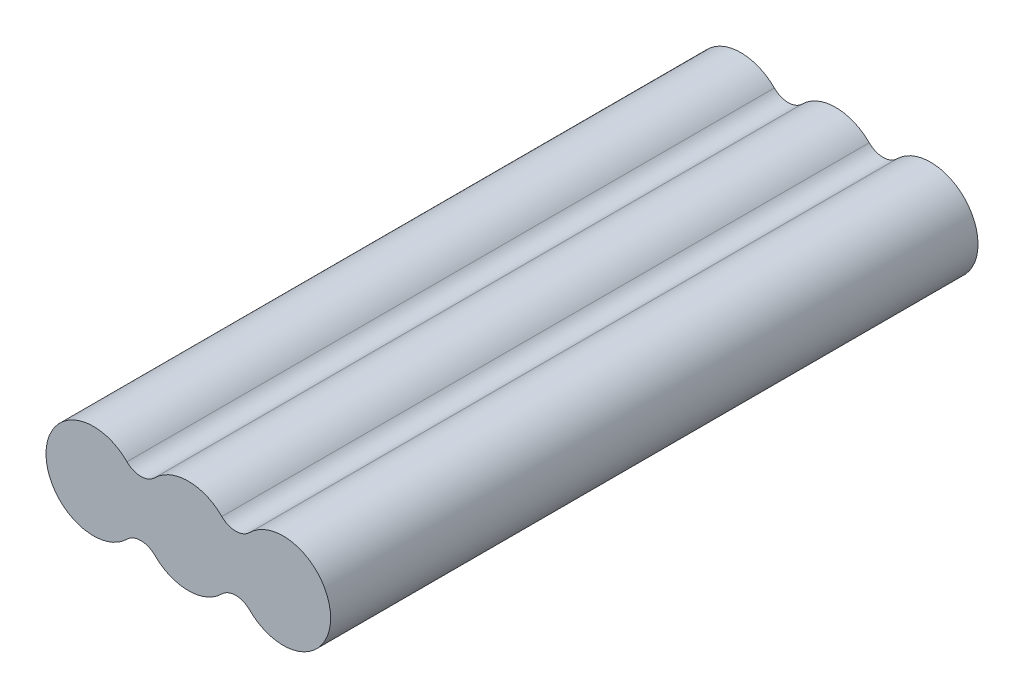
ISO-10303-21;
HEADER;
FILE_DESCRIPTION(('STEP AP214'),'2;1');
FILE_NAME('part.step','',(''),(''),'','','');
FILE_SCHEMA(('AUTOMOTIVE_DESIGN { 1 0 10303 214 1 1 1 1 }'));
ENDSEC;
DATA;
#1=APPLICATION_CONTEXT('core data for automotive mechanical design processes');
#2=APPLICATION_PROTOCOL_DEFINITION('international standard','automotive_design',2000,#1);
#3=PRODUCT_CONTEXT('',#1,'mechanical');
#4=PRODUCT('Part','Part','',(#3));
#5=PRODUCT_RELATED_PRODUCT_CATEGORY('part','',(#4));
#6=PRODUCT_DEFINITION_FORMATION('','',#4);
#7=PRODUCT_DEFINITION_CONTEXT('part definition',#1,'design');
#8=PRODUCT_DEFINITION('design','',#6,#7);
#9=PRODUCT_DEFINITION_SHAPE('','',#8);
#10=(LENGTH_UNIT() NAMED_UNIT(*) SI_UNIT(.MILLI.,.METRE.));
#11=(NAMED_UNIT(*) PLANE_ANGLE_UNIT() SI_UNIT($,.RADIAN.));
#12=(NAMED_UNIT(*) SI_UNIT($,.STERADIAN.) SOLID_ANGLE_UNIT());
#13=UNCERTAINTY_MEASURE_WITH_UNIT(LENGTH_MEASURE(1.E-05),#10,'distance_accuracy_value','');
#14=(GEOMETRIC_REPRESENTATION_CONTEXT(3) GLOBAL_UNCERTAINTY_ASSIGNED_CONTEXT((#13)) GLOBAL_UNIT_ASSIGNED_CONTEXT((#10,
#11,#12)) REPRESENTATION_CONTEXT('',''));
#15=CARTESIAN_POINT('',(0.,0.,0.));
#16=DIRECTION('',(0.,0.,1.));
#17=DIRECTION('',(1.,0.,0.));
#18=AXIS2_PLACEMENT_3D('',#15,#16,#17);
#19=CARTESIAN_POINT('',(-9.525,9.52500000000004,130.));
#20=DIRECTION('',(0.,0.,-1.));
#21=DIRECTION('',(-1.,0.,0.));
#22=AXIS2_PLACEMENT_3D('',#19,#20,#21);
#23=CYLINDRICAL_SURFACE('',#22,3.94538418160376);
#24=CARTESIAN_POINT('',(-9.525,9.52500000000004,0.));
#25=DIRECTION('',(0.,0.,-1.));
#26=DIRECTION('',(1.,0.,0.));
#27=AXIS2_PLACEMENT_3D('',#24,#25,#26);
#28=CIRCLE('',#27,3.94538418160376);
#29=CARTESIAN_POINT('',(-6.73519209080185,6.73519209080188,0.));
#30=VERTEX_POINT('',#29);
#31=CARTESIAN_POINT('',(-12.3148079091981,6.73519209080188,0.));
#32=VERTEX_POINT('',#31);
#33=EDGE_CURVE('E146',#30,#32,#28,.T.);
#34=ORIENTED_EDGE('',*,*,#33,.T.);
#35=DIRECTION('',(0.,0.,-1.));
#36=VECTOR('',#35,1.);
#37=CARTESIAN_POINT('',(-12.3148079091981,6.73519209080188,130.));
#38=LINE('',#37,#36);
#39=CARTESIAN_POINT('',(-12.3148079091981,6.73519209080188,130.));
#40=VERTEX_POINT('',#39);
#41=EDGE_CURVE('E11',#40,#32,#38,.T.);
#42=ORIENTED_EDGE('',*,*,#41,.F.);
#43=CARTESIAN_POINT('',(-9.525,9.52500000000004,130.));
#44=DIRECTION('',(0.,0.,-1.));
#45=DIRECTION('',(1.,0.,0.));
#46=AXIS2_PLACEMENT_3D('',#43,#44,#45);
#47=CIRCLE('',#46,3.94538418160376);
#48=CARTESIAN_POINT('',(-6.73519209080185,6.73519209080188,130.));
#49=VERTEX_POINT('',#48);
#50=EDGE_CURVE('E168',#49,#40,#47,.T.);
#51=ORIENTED_EDGE('',*,*,#50,.F.);
#52=DIRECTION('',(0.,0.,-1.));
#53=VECTOR('',#52,1.);
#54=CARTESIAN_POINT('',(-6.73519209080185,6.73519209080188,130.));
#55=LINE('',#54,#53);
#56=EDGE_CURVE('E142',#49,#30,#55,.T.);
#57=ORIENTED_EDGE('',*,*,#56,.T.);
#58=EDGE_LOOP('',(#34,#42,#51,#57));
#59=FACE_BOUND('',#58,.T.);
#60=ADVANCED_FACE('F45',(#59),#23,.F.);
#61=CARTESIAN_POINT('',(-19.05,0.,130.));
#62=DIRECTION('',(0.,0.,-1.));
#63=DIRECTION('',(-1.,0.,0.));
#64=AXIS2_PLACEMENT_3D('',#61,#62,#63);
#65=CYLINDRICAL_SURFACE('',#64,9.525);
#66=CARTESIAN_POINT('',(-19.05,0.,0.));
#67=DIRECTION('',(0.,0.,1.));
#68=DIRECTION('',(1.,0.,0.));
#69=AXIS2_PLACEMENT_3D('',#66,#67,#68);
#70=CIRCLE('',#69,9.525);
#71=CARTESIAN_POINT('',(-12.3148079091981,-6.73519209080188,0.));
#72=VERTEX_POINT('',#71);
#73=EDGE_CURVE('E150',#32,#72,#70,.T.);
#74=ORIENTED_EDGE('',*,*,#73,.T.);
#75=DIRECTION('',(0.,0.,-1.));
#76=VECTOR('',#75,1.);
#77=CARTESIAN_POINT('',(-12.3148079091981,-6.73519209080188,130.));
#78=LINE('',#77,#76);
#79=CARTESIAN_POINT('',(-12.3148079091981,-6.73519209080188,130.));
#80=VERTEX_POINT('',#79);
#81=EDGE_CURVE('E54',#80,#72,#78,.T.);
#82=ORIENTED_EDGE('',*,*,#81,.F.);
#83=CARTESIAN_POINT('',(-19.05,0.,130.));
#84=DIRECTION('',(0.,0.,1.));
#85=DIRECTION('',(1.,0.,0.));
#86=AXIS2_PLACEMENT_3D('',#83,#84,#85);
#87=CIRCLE('',#86,9.525);
#88=EDGE_CURVE('E105',#40,#80,#87,.T.);
#89=ORIENTED_EDGE('',*,*,#88,.F.);
#90=ORIENTED_EDGE('',*,*,#41,.T.);
#91=EDGE_LOOP('',(#74,#82,#89,#90));
#92=FACE_BOUND('',#91,.T.);
#93=ADVANCED_FACE('F214',(#92),#65,.T.);
#94=CARTESIAN_POINT('',(-9.52500000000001,-9.52500000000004,130.));
#95=DIRECTION('',(0.,0.,-1.));
#96=DIRECTION('',(-1.,0.,0.));
#97=AXIS2_PLACEMENT_3D('',#94,#95,#96);
#98=CYLINDRICAL_SURFACE('',#97,3.94538418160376);
#99=CARTESIAN_POINT('',(-9.52500000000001,-9.52500000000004,0.));
#100=DIRECTION('',(0.,0.,-1.));
#101=DIRECTION('',(-1.,0.,0.));
#102=AXIS2_PLACEMENT_3D('',#99,#100,#101);
#103=CIRCLE('',#102,3.94538418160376);
#104=CARTESIAN_POINT('',(-6.73519209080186,-6.73519209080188,0.));
#105=VERTEX_POINT('',#104);
#106=EDGE_CURVE('E153',#72,#105,#103,.T.);
#107=ORIENTED_EDGE('',*,*,#106,.T.);
#108=DIRECTION('',(0.,0.,-1.));
#109=VECTOR('',#108,1.);
#110=CARTESIAN_POINT('',(-6.73519209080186,-6.73519209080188,130.));
#111=LINE('',#110,#109);
#112=CARTESIAN_POINT('',(-6.73519209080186,-6.73519209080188,130.));
#113=VERTEX_POINT('',#112);
#114=EDGE_CURVE('E179',#113,#105,#111,.T.);
#115=ORIENTED_EDGE('',*,*,#114,.F.);
#116=CARTESIAN_POINT('',(-9.52500000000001,-9.52500000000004,130.));
#117=DIRECTION('',(0.,0.,-1.));
#118=DIRECTION('',(-1.,0.,0.));
#119=AXIS2_PLACEMENT_3D('',#116,#117,#118);
#120=CIRCLE('',#119,3.94538418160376);
#121=EDGE_CURVE('E189',#80,#113,#120,.T.);
#122=ORIENTED_EDGE('',*,*,#121,.F.);
#123=ORIENTED_EDGE('',*,*,#81,.T.);
#124=EDGE_LOOP('',(#107,#115,#122,#123));
#125=FACE_BOUND('',#124,.T.);
#126=ADVANCED_FACE('F187',(#125),#98,.F.);
#127=CARTESIAN_POINT('',(0.,0.,130.));
#128=DIRECTION('',(0.,0.,-1.));
#129=DIRECTION('',(-1.,0.,0.));
#130=AXIS2_PLACEMENT_3D('',#127,#128,#129);
#131=CYLINDRICAL_SURFACE('',#130,9.525);
#132=CARTESIAN_POINT('',(0.,0.,0.));
#133=DIRECTION('',(0.,0.,1.));
#134=DIRECTION('',(1.,0.,0.));
#135=AXIS2_PLACEMENT_3D('',#132,#133,#134);
#136=CIRCLE('',#135,9.525);
#137=CARTESIAN_POINT('',(6.73519209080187,-6.73519209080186,0.));
#138=VERTEX_POINT('',#137);
#139=EDGE_CURVE('E156',#105,#138,#136,.T.);
#140=ORIENTED_EDGE('',*,*,#139,.T.);
#141=DIRECTION('',(0.,0.,-1.));
#142=VECTOR('',#141,1.);
#143=CARTESIAN_POINT('',(6.73519209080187,-6.73519209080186,130.));
#144=LINE('',#143,#142);
#145=CARTESIAN_POINT('',(6.73519209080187,-6.73519209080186,130.));
#146=VERTEX_POINT('',#145);
#147=EDGE_CURVE('E175',#146,#138,#144,.T.);
#148=ORIENTED_EDGE('',*,*,#147,.F.);
#149=CARTESIAN_POINT('',(0.,0.,130.));
#150=DIRECTION('',(0.,0.,1.));
#151=DIRECTION('',(1.,0.,0.));
#152=AXIS2_PLACEMENT_3D('',#149,#150,#151);
#153=CIRCLE('',#152,9.525);
#154=EDGE_CURVE('E202',#113,#146,#153,.T.);
#155=ORIENTED_EDGE('',*,*,#154,.F.);
#156=ORIENTED_EDGE('',*,*,#114,.T.);
#157=EDGE_LOOP('',(#140,#148,#155,#156));
#158=FACE_BOUND('',#157,.T.);
#159=ADVANCED_FACE('F197',(#158),#131,.T.);
#160=CARTESIAN_POINT('',(9.52499999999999,-9.52499999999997,130.));
#161=DIRECTION('',(0.,0.,-1.));
#162=DIRECTION('',(-1.,0.,0.));
#163=AXIS2_PLACEMENT_3D('',#160,#161,#162);
#164=CYLINDRICAL_SURFACE('',#163,3.9453841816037);
#165=CARTESIAN_POINT('',(9.52499999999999,-9.52499999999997,0.));
#166=DIRECTION('',(0.,0.,-1.));
#167=DIRECTION('',(-1.,0.,0.));
#168=AXIS2_PLACEMENT_3D('',#165,#166,#167);
#169=CIRCLE('',#168,3.9453841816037);
#170=CARTESIAN_POINT('',(12.3148079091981,-6.73519209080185,0.));
#171=VERTEX_POINT('',#170);
#172=EDGE_CURVE('E159',#138,#171,#169,.T.);
#173=ORIENTED_EDGE('',*,*,#172,.T.);
#174=DIRECTION('',(0.,0.,-1.));
#175=VECTOR('',#174,1.);
#176=CARTESIAN_POINT('',(12.3148079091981,-6.73519209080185,130.));
#177=LINE('',#176,#175);
#178=CARTESIAN_POINT('',(12.3148079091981,-6.73519209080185,130.));
#179=VERTEX_POINT('',#178);
#180=EDGE_CURVE('E135',#179,#171,#177,.T.);
#181=ORIENTED_EDGE('',*,*,#180,.F.);
#182=CARTESIAN_POINT('',(9.52499999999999,-9.52499999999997,130.));
#183=DIRECTION('',(0.,0.,-1.));
#184=DIRECTION('',(-1.,0.,0.));
#185=AXIS2_PLACEMENT_3D('',#182,#183,#184);
#186=CIRCLE('',#185,3.9453841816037);
#187=EDGE_CURVE('E124',#146,#179,#186,.T.);
#188=ORIENTED_EDGE('',*,*,#187,.F.);
#189=ORIENTED_EDGE('',*,*,#147,.T.);
#190=EDGE_LOOP('',(#173,#181,#188,#189));
#191=FACE_BOUND('',#190,.T.);
#192=ADVANCED_FACE('F200',(#191),#164,.F.);
#193=CARTESIAN_POINT('',(19.05,0.,130.));
#194=DIRECTION('',(0.,0.,-1.));
#195=DIRECTION('',(-1.,0.,0.));
#196=AXIS2_PLACEMENT_3D('',#193,#194,#195);
#197=CYLINDRICAL_SURFACE('',#196,9.52500000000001);
#198=CARTESIAN_POINT('',(19.05,0.,0.));
#199=DIRECTION('',(0.,0.,1.));
#200=DIRECTION('',(1.,0.,0.));
#201=AXIS2_PLACEMENT_3D('',#198,#199,#200);
#202=CIRCLE('',#201,9.52500000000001);
#203=CARTESIAN_POINT('',(12.3148079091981,6.73519209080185,0.));
#204=VERTEX_POINT('',#203);
#205=EDGE_CURVE('E133',#171,#204,#202,.T.);
#206=ORIENTED_EDGE('',*,*,#205,.T.);
#207=DIRECTION('',(0.,0.,-1.));
#208=VECTOR('',#207,1.);
#209=CARTESIAN_POINT('',(12.3148079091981,6.73519209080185,130.));
#210=LINE('',#209,#208);
#211=CARTESIAN_POINT('',(12.3148079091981,6.73519209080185,130.));
#212=VERTEX_POINT('',#211);
#213=EDGE_CURVE('E130',#212,#204,#210,.T.);
#214=ORIENTED_EDGE('',*,*,#213,.F.);
#215=CARTESIAN_POINT('',(19.05,0.,130.));
#216=DIRECTION('',(0.,0.,1.));
#217=DIRECTION('',(1.,0.,0.));
#218=AXIS2_PLACEMENT_3D('',#215,#216,#217);
#219=CIRCLE('',#218,9.52500000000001);
#220=EDGE_CURVE('E118',#179,#212,#219,.T.);
#221=ORIENTED_EDGE('',*,*,#220,.F.);
#222=ORIENTED_EDGE('',*,*,#180,.T.);
#223=EDGE_LOOP('',(#206,#214,#221,#222));
#224=FACE_BOUND('',#223,.T.);
#225=ADVANCED_FACE('F131',(#224),#197,.T.);
#226=CARTESIAN_POINT('',(9.525,9.52499999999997,130.));
#227=DIRECTION('',(0.,0.,-1.));
#228=DIRECTION('',(-1.,0.,0.));
#229=AXIS2_PLACEMENT_3D('',#226,#227,#228);
#230=CYLINDRICAL_SURFACE('',#229,3.94538418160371);
#231=CARTESIAN_POINT('',(9.525,9.52499999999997,0.));
#232=DIRECTION('',(0.,0.,-1.));
#233=DIRECTION('',(1.,0.,0.));
#234=AXIS2_PLACEMENT_3D('',#231,#232,#233);
#235=CIRCLE('',#234,3.94538418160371);
#236=CARTESIAN_POINT('',(6.73519209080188,6.73519209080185,0.));
#237=VERTEX_POINT('',#236);
#238=EDGE_CURVE('E91',#204,#237,#235,.T.);
#239=ORIENTED_EDGE('',*,*,#238,.T.);
#240=DIRECTION('',(0.,0.,-1.));
#241=VECTOR('',#240,1.);
#242=CARTESIAN_POINT('',(6.73519209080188,6.73519209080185,130.));
#243=LINE('',#242,#241);
#244=CARTESIAN_POINT('',(6.73519209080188,6.73519209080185,130.));
#245=VERTEX_POINT('',#244);
#246=EDGE_CURVE('E136',#245,#237,#243,.T.);
#247=ORIENTED_EDGE('',*,*,#246,.F.);
#248=CARTESIAN_POINT('',(9.525,9.52499999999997,130.));
#249=DIRECTION('',(0.,0.,-1.));
#250=DIRECTION('',(1.,0.,0.));
#251=AXIS2_PLACEMENT_3D('',#248,#249,#250);
#252=CIRCLE('',#251,3.94538418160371);
#253=EDGE_CURVE('E122',#212,#245,#252,.T.);
#254=ORIENTED_EDGE('',*,*,#253,.F.);
#255=ORIENTED_EDGE('',*,*,#213,.T.);
#256=EDGE_LOOP('',(#239,#247,#254,#255));
#257=FACE_BOUND('',#256,.T.);
#258=ADVANCED_FACE('F138',(#257),#230,.F.);
#259=CARTESIAN_POINT('',(0.,0.,130.));
#260=DIRECTION('',(0.,0.,-1.));
#261=DIRECTION('',(-1.,0.,0.));
#262=AXIS2_PLACEMENT_3D('',#259,#260,#261);
#263=CYLINDRICAL_SURFACE('',#262,9.525);
#264=CARTESIAN_POINT('',(0.,0.,0.));
#265=DIRECTION('',(0.,0.,1.));
#266=DIRECTION('',(1.,0.,0.));
#267=AXIS2_PLACEMENT_3D('',#264,#265,#266);
#268=CIRCLE('',#267,9.525);
#269=EDGE_CURVE('E97',#237,#30,#268,.T.);
#270=ORIENTED_EDGE('',*,*,#269,.T.);
#271=ORIENTED_EDGE('',*,*,#56,.F.);
#272=CARTESIAN_POINT('',(0.,0.,130.));
#273=DIRECTION('',(0.,0.,1.));
#274=DIRECTION('',(1.,0.,0.));
#275=AXIS2_PLACEMENT_3D('',#272,#273,#274);
#276=CIRCLE('',#275,9.525);
#277=EDGE_CURVE('E62',#245,#49,#276,.T.);
#278=ORIENTED_EDGE('',*,*,#277,.F.);
#279=ORIENTED_EDGE('',*,*,#246,.T.);
#280=EDGE_LOOP('',(#270,#271,#278,#279));
#281=FACE_BOUND('',#280,.T.);
#282=ADVANCED_FACE('F230',(#281),#263,.T.);
#283=CARTESIAN_POINT('',(-4.7625,4.76250000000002,130.));
#284=DIRECTION('',(0.,0.,1.));
#285=DIRECTION('',(1.,0.,0.));
#286=AXIS2_PLACEMENT_3D('',#283,#284,#285);
#287=PLANE('',#286);
#288=ORIENTED_EDGE('',*,*,#50,.T.);
#289=ORIENTED_EDGE('',*,*,#88,.T.);
#290=ORIENTED_EDGE('',*,*,#121,.T.);
#291=ORIENTED_EDGE('',*,*,#154,.T.);
#292=ORIENTED_EDGE('',*,*,#187,.T.);
#293=ORIENTED_EDGE('',*,*,#220,.T.);
#294=ORIENTED_EDGE('',*,*,#253,.T.);
#295=ORIENTED_EDGE('',*,*,#277,.T.);
#296=EDGE_LOOP('',(#288,#289,#290,#291,#292,#293,#294,#295));
#297=FACE_BOUND('',#296,.T.);
#298=ADVANCED_FACE('F120',(#297),#287,.T.);
#299=CARTESIAN_POINT('',(-4.7625,4.76250000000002,0.));
#300=DIRECTION('',(0.,0.,1.));
#301=DIRECTION('',(1.,0.,0.));
#302=AXIS2_PLACEMENT_3D('',#299,#300,#301);
#303=PLANE('',#302);
#304=ORIENTED_EDGE('',*,*,#33,.F.);
#305=ORIENTED_EDGE('',*,*,#269,.F.);
#306=ORIENTED_EDGE('',*,*,#238,.F.);
#307=ORIENTED_EDGE('',*,*,#205,.F.);
#308=ORIENTED_EDGE('',*,*,#172,.F.);
#309=ORIENTED_EDGE('',*,*,#139,.F.);
#310=ORIENTED_EDGE('',*,*,#106,.F.);
#311=ORIENTED_EDGE('',*,*,#73,.F.);
#312=EDGE_LOOP('',(#304,#305,#306,#307,#308,#309,#310,#311));
#313=FACE_BOUND('',#312,.T.);
#314=ADVANCED_FACE('F193',(#313),#303,.F.);
#315=CLOSED_SHELL('',(#60,#93,#126,#159,#192,#225,#258,#282,#298,#314));
#316=MANIFOLD_SOLID_BREP('B2',#315);
#317=ADVANCED_BREP_SHAPE_REPRESENTATION('',(#18,#316),#14);
#318=SHAPE_DEFINITION_REPRESENTATION(#9,#317);
ENDSEC;
END-ISO-10303-21;
